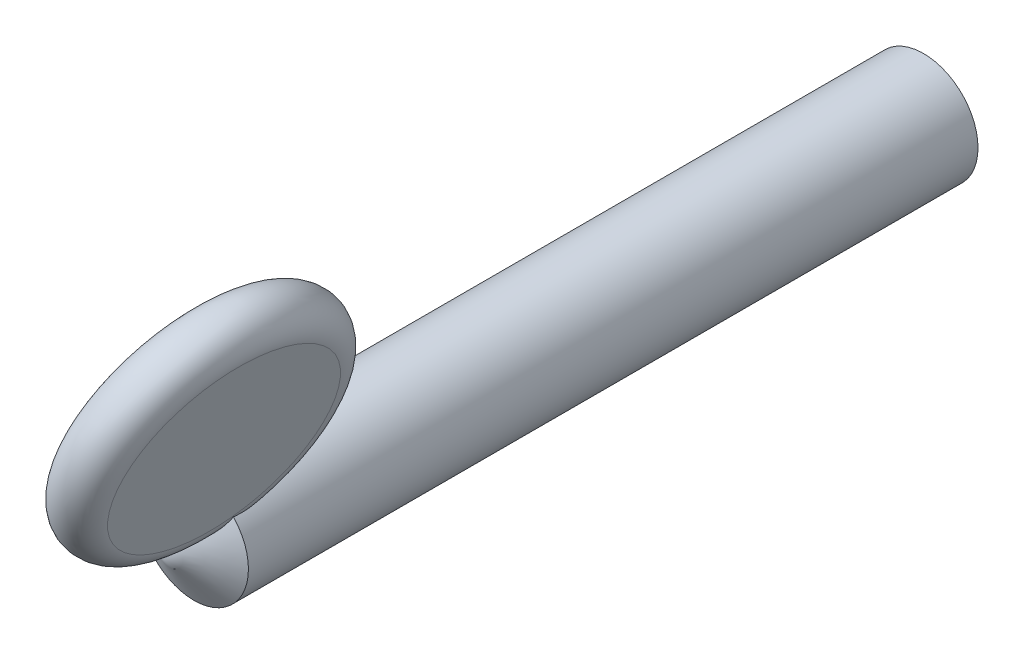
ISO-10303-21;
HEADER;
FILE_DESCRIPTION(('STEP AP214'),'2;1');
FILE_NAME('part.step','',(''),(''),'','','');
FILE_SCHEMA(('AUTOMOTIVE_DESIGN { 1 0 10303 214 1 1 1 1 }'));
ENDSEC;
DATA;
#1=APPLICATION_CONTEXT('core data for automotive mechanical design processes');
#2=APPLICATION_PROTOCOL_DEFINITION('international standard','automotive_design',2000,#1);
#3=PRODUCT_CONTEXT('',#1,'mechanical');
#4=PRODUCT('Part','Part','',(#3));
#5=PRODUCT_RELATED_PRODUCT_CATEGORY('part','',(#4));
#6=PRODUCT_DEFINITION_FORMATION('','',#4);
#7=PRODUCT_DEFINITION_CONTEXT('part definition',#1,'design');
#8=PRODUCT_DEFINITION('design','',#6,#7);
#9=PRODUCT_DEFINITION_SHAPE('','',#8);
#10=(LENGTH_UNIT() NAMED_UNIT(*) SI_UNIT(.MILLI.,.METRE.));
#11=(NAMED_UNIT(*) PLANE_ANGLE_UNIT() SI_UNIT($,.RADIAN.));
#12=(NAMED_UNIT(*) SI_UNIT($,.STERADIAN.) SOLID_ANGLE_UNIT());
#13=UNCERTAINTY_MEASURE_WITH_UNIT(LENGTH_MEASURE(1.E-05),#10,'distance_accuracy_value','');
#14=(GEOMETRIC_REPRESENTATION_CONTEXT(3) GLOBAL_UNCERTAINTY_ASSIGNED_CONTEXT((#13)) GLOBAL_UNIT_ASSIGNED_CONTEXT((#10,
#11,#12)) REPRESENTATION_CONTEXT('',''));
#15=CARTESIAN_POINT('',(0.,0.,0.));
#16=DIRECTION('',(0.,0.,1.));
#17=DIRECTION('',(1.,0.,0.));
#18=AXIS2_PLACEMENT_3D('',#15,#16,#17);
#19=CARTESIAN_POINT('',(3.27279707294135,27.2940836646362,140.293765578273));
#20=DIRECTION('',(0.939033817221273,-0.33333333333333,0.084287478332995));
#21=DIRECTION('',(0.334523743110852,0.942387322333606,0.));
#22=AXIS2_PLACEMENT_3D('',#19,#20,#21);
#23=PLANE('',#22);
#24=CARTESIAN_POINT('',(3.27279707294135,27.2940836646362,140.293765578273));
#25=DIRECTION('',(-0.939033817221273,0.33333333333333,-0.084287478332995));
#26=DIRECTION('',(-0.334523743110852,-0.942387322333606,0.));
#27=AXIS2_PLACEMENT_3D('',#24,#25,#26);
#28=CIRCLE('',#27,19.);
#29=CARTESIAN_POINT('',(-3.08315404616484,9.38872454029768,140.293765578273));
#30=VERTEX_POINT('',#29);
#31=EDGE_CURVE('E11',#30,#30,#28,.T.);
#32=ORIENTED_EDGE('',*,*,#31,.T.);
#33=EDGE_LOOP('',(#32));
#34=FACE_BOUND('',#33,.T.);
#35=ADVANCED_FACE('F45',(#34),#23,.F.);
#36=CARTESIAN_POINT('',(7.96796615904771,25.6274169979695,140.715202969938));
#37=DIRECTION('',(-0.939033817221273,0.33333333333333,-0.084287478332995));
#38=DIRECTION('',(-0.334523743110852,-0.942387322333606,0.));
#39=AXIS2_PLACEMENT_3D('',#36,#37,#38);
#40=TOROIDAL_SURFACE('',#39,19.,5.);
#41=ORIENTED_EDGE('',*,*,#31,.F.);
#42=EDGE_LOOP('',(#41));
#43=FACE_BOUND('',#42,.T.);
#44=CARTESIAN_POINT('',(12.6631352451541,23.9607503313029,141.136640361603));
#45=DIRECTION('',(-0.939033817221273,0.33333333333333,-0.084287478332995));
#46=DIRECTION('',(-0.334523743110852,-0.942387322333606,0.));
#47=AXIS2_PLACEMENT_3D('',#44,#45,#46);
#48=CIRCLE('',#47,19.);
#49=CARTESIAN_POINT('',(6.30718412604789,6.05539120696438,141.136640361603));
#50=VERTEX_POINT('',#49);
#51=EDGE_CURVE('E51',#50,#50,#48,.T.);
#52=ORIENTED_EDGE('',*,*,#51,.T.);
#53=EDGE_LOOP('',(#52));
#54=FACE_BOUND('',#53,.T.);
#55=ADVANCED_FACE('F57',(#43,#54),#40,.T.);
#56=CARTESIAN_POINT('',(12.6631352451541,23.9607503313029,141.136640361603));
#57=DIRECTION('',(-0.939033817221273,0.33333333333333,-0.084287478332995));
#58=DIRECTION('',(-0.334523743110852,-0.942387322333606,0.));
#59=AXIS2_PLACEMENT_3D('',#56,#57,#58);
#60=PLANE('',#59);
#61=ORIENTED_EDGE('',*,*,#51,.F.);
#62=EDGE_LOOP('',(#61));
#63=FACE_BOUND('',#62,.T.);
#64=ADVANCED_FACE('F59',(#63),#60,.F.);
#65=CLOSED_SHELL('',(#35,#55,#64));
#66=MANIFOLD_SOLID_BREP('B2',#65);
#67=CARTESIAN_POINT('',(0.,10.,0.));
#68=DIRECTION('',(0.,0.,1.));
#69=DIRECTION('',(1.,0.,0.));
#70=AXIS2_PLACEMENT_3D('',#67,#68,#69);
#71=PLANE('',#70);
#72=CARTESIAN_POINT('',(0.,0.,0.));
#73=DIRECTION('',(0.,0.,1.));
#74=DIRECTION('',(1.,0.,0.));
#75=AXIS2_PLACEMENT_3D('',#72,#73,#74);
#76=CIRCLE('',#75,10.);
#77=CARTESIAN_POINT('',(10.,0.,0.));
#78=VERTEX_POINT('',#77);
#79=EDGE_CURVE('E92',#78,#78,#76,.T.);
#80=ORIENTED_EDGE('',*,*,#79,.F.);
#81=EDGE_LOOP('',(#80));
#82=FACE_BOUND('',#81,.T.);
#83=ADVANCED_FACE('F86',(#82),#71,.F.);
#84=CARTESIAN_POINT('',(0.,0.,133.991393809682));
#85=DIRECTION('',(0.,0.,-1.));
#86=DIRECTION('',(-1.,0.,0.));
#87=AXIS2_PLACEMENT_3D('',#84,#85,#86);
#88=CONICAL_SURFACE('',#87,10.,1.02974425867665);
#89=CARTESIAN_POINT('',(0.,0.,139.999999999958));
#90=VERTEX_POINT('',#89);
#91=VERTEX_LOOP('',#90);
#92=FACE_BOUND('',#91,.T.);
#93=CARTESIAN_POINT('',(0.,0.,133.991393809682));
#94=DIRECTION('',(0.,0.,1.));
#95=DIRECTION('',(1.,0.,0.));
#96=AXIS2_PLACEMENT_3D('',#93,#94,#95);
#97=CIRCLE('',#96,10.);
#98=CARTESIAN_POINT('',(10.,0.,133.991393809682));
#99=VERTEX_POINT('',#98);
#100=EDGE_CURVE('E43',#99,#99,#97,.T.);
#101=ORIENTED_EDGE('',*,*,#100,.T.);
#102=EDGE_LOOP('',(#101));
#103=FACE_BOUND('',#102,.T.);
#104=ADVANCED_FACE('F95',(#92,#103),#88,.T.);
#105=CARTESIAN_POINT('',(0.,0.,0.));
#106=DIRECTION('',(0.,0.,1.));
#107=DIRECTION('',(1.,0.,0.));
#108=AXIS2_PLACEMENT_3D('',#105,#106,#107);
#109=CYLINDRICAL_SURFACE('',#108,10.);
#110=ORIENTED_EDGE('',*,*,#100,.F.);
#111=EDGE_LOOP('',(#110));
#112=FACE_BOUND('',#111,.T.);
#113=ORIENTED_EDGE('',*,*,#79,.T.);
#114=EDGE_LOOP('',(#113));
#115=FACE_BOUND('',#114,.T.);
#116=ADVANCED_FACE('F98',(#112,#115),#109,.T.);
#117=CLOSED_SHELL('',(#83,#104,#116));
#118=MANIFOLD_SOLID_BREP('B6',#117);
#119=ADVANCED_BREP_SHAPE_REPRESENTATION('',(#18,#66,#118),#14);
#120=SHAPE_DEFINITION_REPRESENTATION(#9,#119);
ENDSEC;
END-ISO-10303-21;
